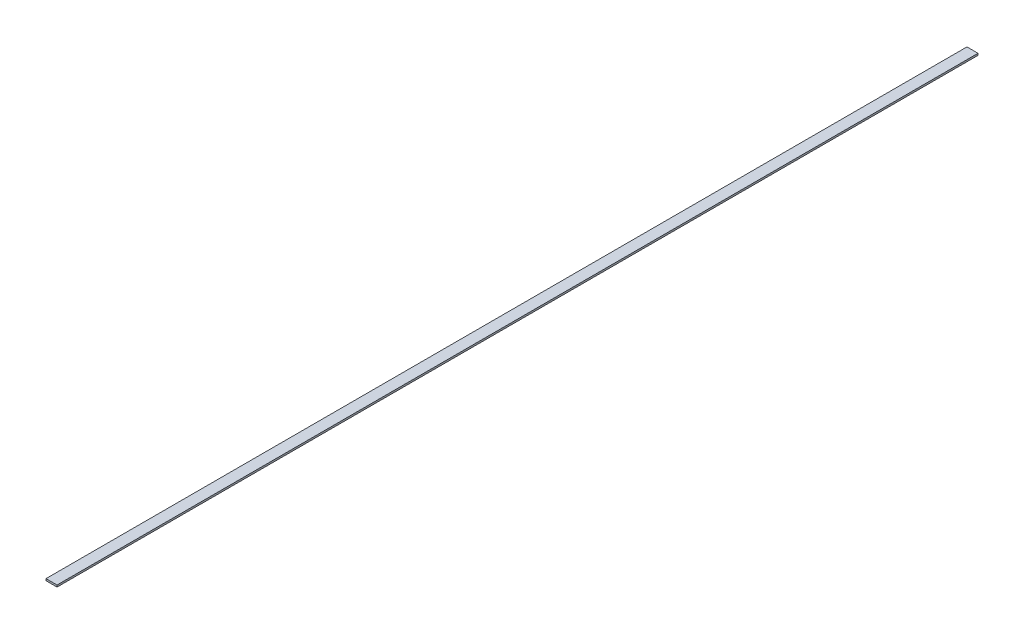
from build123d import *

# Parameters (mm, degrees)
SKETCH1_W           = 12
SKETCH1_H           = 2
BOSS_EXTRUDE1_DEPTH = 1000


with BuildPart() as part:
    # Sketch1 → Boss-Extrude1 (new body)
    with BuildSketch(Plane.XY):
        with Locations((-8, 8.098360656)):
            Rectangle(SKETCH1_W, SKETCH1_H)
    extrude(amount=BOSS_EXTRUDE1_DEPTH)


solid = part.part
